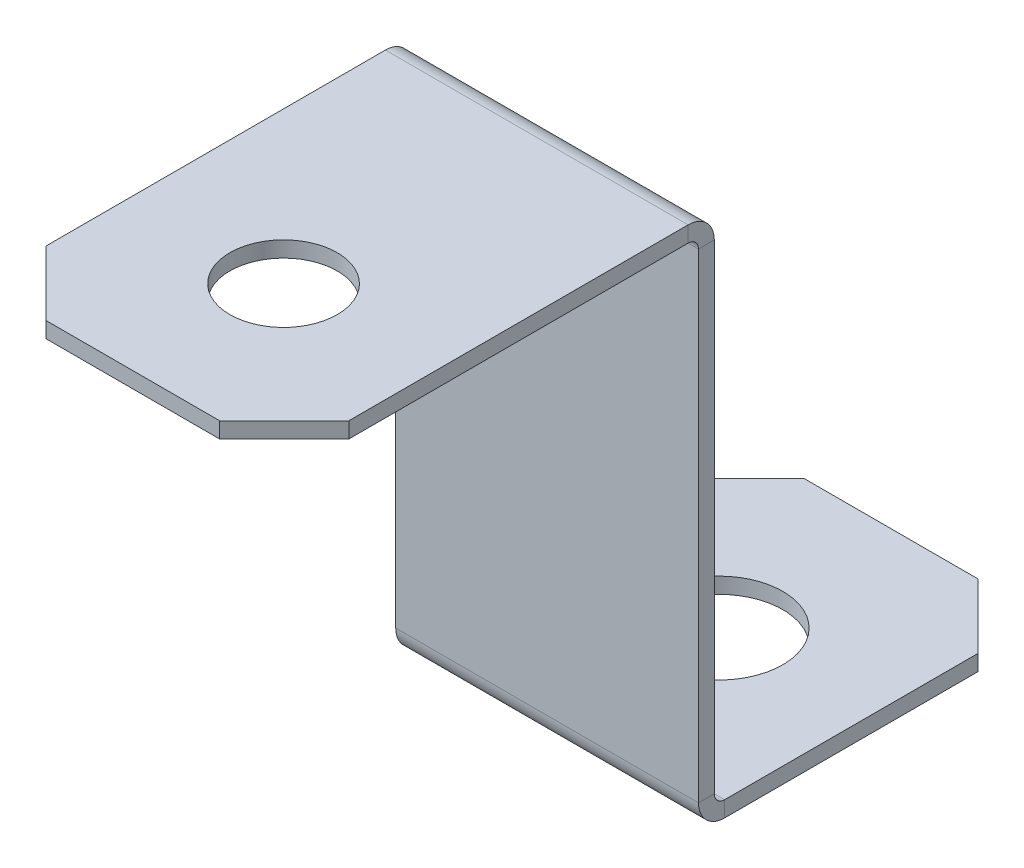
ISO-10303-21;
HEADER;
FILE_DESCRIPTION(('STEP AP214'),'2;1');
FILE_NAME('part.step','',(''),(''),'','','');
FILE_SCHEMA(('AUTOMOTIVE_DESIGN { 1 0 10303 214 1 1 1 1 }'));
ENDSEC;
DATA;
#1=APPLICATION_CONTEXT('core data for automotive mechanical design processes');
#2=APPLICATION_PROTOCOL_DEFINITION('international standard','automotive_design',2000,#1);
#3=PRODUCT_CONTEXT('',#1,'mechanical');
#4=PRODUCT('Part','Part','',(#3));
#5=PRODUCT_RELATED_PRODUCT_CATEGORY('part','',(#4));
#6=PRODUCT_DEFINITION_FORMATION('','',#4);
#7=PRODUCT_DEFINITION_CONTEXT('part definition',#1,'design');
#8=PRODUCT_DEFINITION('design','',#6,#7);
#9=PRODUCT_DEFINITION_SHAPE('','',#8);
#10=(LENGTH_UNIT() NAMED_UNIT(*) SI_UNIT(.MILLI.,.METRE.));
#11=(NAMED_UNIT(*) PLANE_ANGLE_UNIT() SI_UNIT($,.RADIAN.));
#12=(NAMED_UNIT(*) SI_UNIT($,.STERADIAN.) SOLID_ANGLE_UNIT());
#13=UNCERTAINTY_MEASURE_WITH_UNIT(LENGTH_MEASURE(1.E-05),#10,'distance_accuracy_value','');
#14=(GEOMETRIC_REPRESENTATION_CONTEXT(3) GLOBAL_UNCERTAINTY_ASSIGNED_CONTEXT((#13)) GLOBAL_UNIT_ASSIGNED_CONTEXT((#10,
#11,#12)) REPRESENTATION_CONTEXT('',''));
#15=CARTESIAN_POINT('',(0.,0.,0.));
#16=DIRECTION('',(0.,0.,1.));
#17=DIRECTION('',(1.,0.,0.));
#18=AXIS2_PLACEMENT_3D('',#15,#16,#17);
#19=CARTESIAN_POINT('',(5.588,-0.9652,-10.3124));
#20=DIRECTION('',(1.,0.,0.));
#21=DIRECTION('',(0.,0.,-1.));
#22=AXIS2_PLACEMENT_3D('',#19,#20,#21);
#23=PLANE('',#22);
#24=DIRECTION('',(0.,0.,1.));
#25=VECTOR('',#24,1.);
#26=CARTESIAN_POINT('',(5.588,-0.9652,-10.3124));
#27=LINE('',#26,#25);
#28=CARTESIAN_POINT('',(5.588,-0.9652,-10.3124));
#29=VERTEX_POINT('',#28);
#30=CARTESIAN_POINT('',(5.588,-0.9652,-9.7282));
#31=VERTEX_POINT('',#30);
#32=EDGE_CURVE('E270',#29,#31,#27,.T.);
#33=ORIENTED_EDGE('',*,*,#32,.F.);
#34=CARTESIAN_POINT('',(5.588,-0.9652,-9.3472));
#35=DIRECTION('',(1.,0.,0.));
#36=DIRECTION('',(0.,0.,-1.));
#37=AXIS2_PLACEMENT_3D('',#34,#35,#36);
#38=CIRCLE('',#37,0.9652);
#39=CARTESIAN_POINT('',(5.588,0.,-9.3472));
#40=VERTEX_POINT('',#39);
#41=EDGE_CURVE('E187',#40,#29,#38,.F.);
#42=ORIENTED_EDGE('',*,*,#41,.F.);
#43=DIRECTION('',(0.,1.,0.));
#44=VECTOR('',#43,1.);
#45=CARTESIAN_POINT('',(5.588,-0.5842,-9.3472));
#46=LINE('',#45,#44);
#47=CARTESIAN_POINT('',(5.588,-0.5842,-9.3472));
#48=VERTEX_POINT('',#47);
#49=EDGE_CURVE('E267',#48,#40,#46,.T.);
#50=ORIENTED_EDGE('',*,*,#49,.F.);
#51=CARTESIAN_POINT('',(5.588,-0.9652,-9.3472));
#52=DIRECTION('',(1.,0.,0.));
#53=DIRECTION('',(0.,0.,-1.));
#54=AXIS2_PLACEMENT_3D('',#51,#52,#53);
#55=CIRCLE('',#54,0.381);
#56=EDGE_CURVE('E197',#48,#31,#55,.F.);
#57=ORIENTED_EDGE('',*,*,#56,.T.);
#58=EDGE_LOOP('',(#33,#42,#50,#57));
#59=FACE_BOUND('',#58,.T.);
#60=ADVANCED_FACE('F37',(#59),#23,.T.);
#61=CARTESIAN_POINT('',(5.588,-0.5842,-9.3472));
#62=DIRECTION('',(1.,0.,0.));
#63=DIRECTION('',(0.,0.,-1.));
#64=AXIS2_PLACEMENT_3D('',#61,#62,#63);
#65=PLANE('',#64);
#66=DIRECTION('',(0.,-1.,0.));
#67=VECTOR('',#66,1.);
#68=CARTESIAN_POINT('',(5.588,0.,-10.3124));
#69=LINE('',#68,#67);
#70=CARTESIAN_POINT('',(5.588,-18.669,-10.3124));
#71=VERTEX_POINT('',#70);
#72=EDGE_CURVE('E185',#29,#71,#69,.T.);
#73=ORIENTED_EDGE('',*,*,#72,.F.);
#74=ORIENTED_EDGE('',*,*,#32,.T.);
#75=DIRECTION('',(0.,-1.,0.));
#76=VECTOR('',#75,1.);
#77=CARTESIAN_POINT('',(5.588,0.,-9.7282));
#78=LINE('',#77,#76);
#79=CARTESIAN_POINT('',(5.588,-18.669,-9.7282));
#80=VERTEX_POINT('',#79);
#81=EDGE_CURVE('E200',#31,#80,#78,.T.);
#82=ORIENTED_EDGE('',*,*,#81,.T.);
#83=DIRECTION('',(0.,0.,-1.));
#84=VECTOR('',#83,1.);
#85=CARTESIAN_POINT('',(5.588,-18.669,-9.7282));
#86=LINE('',#85,#84);
#87=EDGE_CURVE('E162',#80,#71,#86,.T.);
#88=ORIENTED_EDGE('',*,*,#87,.T.);
#89=EDGE_LOOP('',(#73,#74,#82,#88));
#90=FACE_BOUND('',#89,.T.);
#91=ADVANCED_FACE('F347',(#90),#65,.T.);
#92=CARTESIAN_POINT('',(-5.588,0.,-9.3472));
#93=DIRECTION('',(-1.,0.,0.));
#94=DIRECTION('',(0.,0.,1.));
#95=AXIS2_PLACEMENT_3D('',#92,#93,#94);
#96=PLANE('',#95);
#97=DIRECTION('',(0.,-1.,0.));
#98=VECTOR('',#97,1.);
#99=CARTESIAN_POINT('',(-5.588,0.,-9.3472));
#100=LINE('',#99,#98);
#101=CARTESIAN_POINT('',(-5.588,0.,-9.3472));
#102=VERTEX_POINT('',#101);
#103=CARTESIAN_POINT('',(-5.588,-0.5842,-9.3472));
#104=VERTEX_POINT('',#103);
#105=EDGE_CURVE('E264',#102,#104,#100,.T.);
#106=ORIENTED_EDGE('',*,*,#105,.F.);
#107=CARTESIAN_POINT('',(-5.588,-0.9652,-9.3472));
#108=DIRECTION('',(1.,0.,0.));
#109=DIRECTION('',(0.,0.,-1.));
#110=AXIS2_PLACEMENT_3D('',#107,#108,#109);
#111=CIRCLE('',#110,0.9652);
#112=CARTESIAN_POINT('',(-5.588,-0.9652,-10.3124));
#113=VERTEX_POINT('',#112);
#114=EDGE_CURVE('E215',#102,#113,#111,.F.);
#115=ORIENTED_EDGE('',*,*,#114,.T.);
#116=DIRECTION('',(0.,0.,-1.));
#117=VECTOR('',#116,1.);
#118=CARTESIAN_POINT('',(-5.588,-0.9652,-9.7282));
#119=LINE('',#118,#117);
#120=CARTESIAN_POINT('',(-5.588,-0.9652,-9.7282));
#121=VERTEX_POINT('',#120);
#122=EDGE_CURVE('E161',#121,#113,#119,.T.);
#123=ORIENTED_EDGE('',*,*,#122,.F.);
#124=CARTESIAN_POINT('',(-5.588,-0.9652,-9.3472));
#125=DIRECTION('',(1.,0.,0.));
#126=DIRECTION('',(0.,0.,-1.));
#127=AXIS2_PLACEMENT_3D('',#124,#125,#126);
#128=CIRCLE('',#127,0.381);
#129=EDGE_CURVE('E222',#104,#121,#128,.F.);
#130=ORIENTED_EDGE('',*,*,#129,.F.);
#131=EDGE_LOOP('',(#106,#115,#123,#130));
#132=FACE_BOUND('',#131,.T.);
#133=ADVANCED_FACE('F353',(#132),#96,.T.);
#134=CARTESIAN_POINT('',(-5.588,-0.9652,-9.7282));
#135=DIRECTION('',(-1.,0.,0.));
#136=DIRECTION('',(0.,0.,1.));
#137=AXIS2_PLACEMENT_3D('',#134,#135,#136);
#138=PLANE('',#137);
#139=DIRECTION('',(0.,0.,-1.));
#140=VECTOR('',#139,1.);
#141=CARTESIAN_POINT('',(-5.588,-0.5842,5.5626));
#142=LINE('',#141,#140);
#143=CARTESIAN_POINT('',(-5.588,-0.5842,3.18135000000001));
#144=VERTEX_POINT('',#143);
#145=EDGE_CURVE('E220',#144,#104,#142,.T.);
#146=ORIENTED_EDGE('',*,*,#145,.F.);
#147=DIRECTION('',(0.,1.,0.));
#148=VECTOR('',#147,1.);
#149=CARTESIAN_POINT('',(-5.588,-0.9652,3.18135000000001));
#150=LINE('',#149,#148);
#151=CARTESIAN_POINT('',(-5.588,0.,3.18135000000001));
#152=VERTEX_POINT('',#151);
#153=EDGE_CURVE('E272',#144,#152,#150,.T.);
#154=ORIENTED_EDGE('',*,*,#153,.T.);
#155=DIRECTION('',(0.,0.,-1.));
#156=VECTOR('',#155,1.);
#157=CARTESIAN_POINT('',(-5.588,0.,5.5626));
#158=LINE('',#157,#156);
#159=EDGE_CURVE('E218',#152,#102,#158,.T.);
#160=ORIENTED_EDGE('',*,*,#159,.T.);
#161=ORIENTED_EDGE('',*,*,#105,.T.);
#162=EDGE_LOOP('',(#146,#154,#160,#161));
#163=FACE_BOUND('',#162,.T.);
#164=ADVANCED_FACE('F451',(#163),#138,.T.);
#165=CARTESIAN_POINT('',(5.588,-19.05,-10.6934));
#166=DIRECTION('',(1.,0.,0.));
#167=DIRECTION('',(0.,0.,-1.));
#168=AXIS2_PLACEMENT_3D('',#165,#166,#167);
#169=PLANE('',#168);
#170=DIRECTION('',(0.,-1.,0.));
#171=VECTOR('',#170,1.);
#172=CARTESIAN_POINT('',(5.588,-19.05,-10.6934));
#173=LINE('',#172,#171);
#174=CARTESIAN_POINT('',(5.588,-19.05,-10.6934));
#175=VERTEX_POINT('',#174);
#176=CARTESIAN_POINT('',(5.588,-19.6342,-10.6934));
#177=VERTEX_POINT('',#176);
#178=EDGE_CURVE('E152',#175,#177,#173,.T.);
#179=ORIENTED_EDGE('',*,*,#178,.F.);
#180=CARTESIAN_POINT('',(5.588,-18.669,-10.6934));
#181=DIRECTION('',(-1.,0.,0.));
#182=DIRECTION('',(0.,0.,1.));
#183=AXIS2_PLACEMENT_3D('',#180,#181,#182);
#184=CIRCLE('',#183,0.381);
#185=EDGE_CURVE('E156',#71,#175,#184,.F.);
#186=ORIENTED_EDGE('',*,*,#185,.F.);
#187=ORIENTED_EDGE('',*,*,#87,.F.);
#188=CARTESIAN_POINT('',(5.588,-18.669,-10.6934));
#189=DIRECTION('',(1.,0.,0.));
#190=DIRECTION('',(0.,0.,-1.));
#191=AXIS2_PLACEMENT_3D('',#188,#189,#190);
#192=CIRCLE('',#191,0.9652);
#193=EDGE_CURVE('E159',#80,#177,#192,.T.);
#194=ORIENTED_EDGE('',*,*,#193,.T.);
#195=EDGE_LOOP('',(#179,#186,#187,#194));
#196=FACE_BOUND('',#195,.T.);
#197=ADVANCED_FACE('F154',(#196),#169,.T.);
#198=CARTESIAN_POINT('',(5.588,-18.669,-9.7282));
#199=DIRECTION('',(1.,0.,0.));
#200=DIRECTION('',(0.,0.,-1.));
#201=AXIS2_PLACEMENT_3D('',#198,#199,#200);
#202=PLANE('',#201);
#203=DIRECTION('',(0.,0.,-1.));
#204=VECTOR('',#203,1.);
#205=CARTESIAN_POINT('',(5.588,-19.6342,-10.3124));
#206=LINE('',#205,#204);
#207=CARTESIAN_POINT('',(5.588,-19.6342,-20.04695));
#208=VERTEX_POINT('',#207);
#209=EDGE_CURVE('E180',#177,#208,#206,.T.);
#210=ORIENTED_EDGE('',*,*,#209,.T.);
#211=DIRECTION('',(0.,1.,0.));
#212=VECTOR('',#211,1.);
#213=CARTESIAN_POINT('',(5.588,-18.669,-20.04695));
#214=LINE('',#213,#212);
#215=CARTESIAN_POINT('',(5.588,-19.05,-20.04695));
#216=VERTEX_POINT('',#215);
#217=EDGE_CURVE('E11',#208,#216,#214,.T.);
#218=ORIENTED_EDGE('',*,*,#217,.T.);
#219=DIRECTION('',(0.,0.,-1.));
#220=VECTOR('',#219,1.);
#221=CARTESIAN_POINT('',(5.588,-19.05,-10.3124));
#222=LINE('',#221,#220);
#223=EDGE_CURVE('E169',#175,#216,#222,.T.);
#224=ORIENTED_EDGE('',*,*,#223,.F.);
#225=ORIENTED_EDGE('',*,*,#178,.T.);
#226=EDGE_LOOP('',(#210,#218,#224,#225));
#227=FACE_BOUND('',#226,.T.);
#228=ADVANCED_FACE('F179',(#227),#202,.T.);
#229=CARTESIAN_POINT('',(-5.588,-18.669,-10.3124));
#230=DIRECTION('',(-1.,0.,0.));
#231=DIRECTION('',(0.,0.,1.));
#232=AXIS2_PLACEMENT_3D('',#229,#230,#231);
#233=PLANE('',#232);
#234=DIRECTION('',(0.,0.,1.));
#235=VECTOR('',#234,1.);
#236=CARTESIAN_POINT('',(-5.588,-18.669,-10.3124));
#237=LINE('',#236,#235);
#238=CARTESIAN_POINT('',(-5.588,-18.669,-10.3124));
#239=VERTEX_POINT('',#238);
#240=CARTESIAN_POINT('',(-5.588,-18.669,-9.7282));
#241=VERTEX_POINT('',#240);
#242=EDGE_CURVE('E260',#239,#241,#237,.T.);
#243=ORIENTED_EDGE('',*,*,#242,.F.);
#244=CARTESIAN_POINT('',(-5.588,-18.669,-10.6934));
#245=DIRECTION('',(-1.,0.,0.));
#246=DIRECTION('',(0.,0.,1.));
#247=AXIS2_PLACEMENT_3D('',#244,#245,#246);
#248=CIRCLE('',#247,0.381);
#249=CARTESIAN_POINT('',(-5.588,-19.05,-10.6934));
#250=VERTEX_POINT('',#249);
#251=EDGE_CURVE('E210',#239,#250,#248,.F.);
#252=ORIENTED_EDGE('',*,*,#251,.T.);
#253=DIRECTION('',(0.,1.,0.));
#254=VECTOR('',#253,1.);
#255=CARTESIAN_POINT('',(-5.588,-19.6342,-10.6934));
#256=LINE('',#255,#254);
#257=CARTESIAN_POINT('',(-5.588,-19.6342,-10.6934));
#258=VERTEX_POINT('',#257);
#259=EDGE_CURVE('E258',#258,#250,#256,.T.);
#260=ORIENTED_EDGE('',*,*,#259,.F.);
#261=CARTESIAN_POINT('',(-5.588,-18.669,-10.6934));
#262=DIRECTION('',(1.,0.,0.));
#263=DIRECTION('',(0.,0.,-1.));
#264=AXIS2_PLACEMENT_3D('',#261,#262,#263);
#265=CIRCLE('',#264,0.9652);
#266=EDGE_CURVE('E228',#241,#258,#265,.T.);
#267=ORIENTED_EDGE('',*,*,#266,.F.);
#268=EDGE_LOOP('',(#243,#252,#260,#267));
#269=FACE_BOUND('',#268,.T.);
#270=ADVANCED_FACE('F436',(#269),#233,.T.);
#271=CARTESIAN_POINT('',(-5.588,-19.6342,-10.6934));
#272=DIRECTION('',(-1.,0.,0.));
#273=DIRECTION('',(0.,0.,1.));
#274=AXIS2_PLACEMENT_3D('',#271,#272,#273);
#275=PLANE('',#274);
#276=DIRECTION('',(0.,-1.,0.));
#277=VECTOR('',#276,1.);
#278=CARTESIAN_POINT('',(-5.588,0.,-10.3124));
#279=LINE('',#278,#277);
#280=EDGE_CURVE('E212',#113,#239,#279,.T.);
#281=ORIENTED_EDGE('',*,*,#280,.T.);
#282=ORIENTED_EDGE('',*,*,#242,.T.);
#283=DIRECTION('',(0.,-1.,0.));
#284=VECTOR('',#283,1.);
#285=CARTESIAN_POINT('',(-5.588,0.,-9.7282));
#286=LINE('',#285,#284);
#287=EDGE_CURVE('E225',#121,#241,#286,.T.);
#288=ORIENTED_EDGE('',*,*,#287,.F.);
#289=ORIENTED_EDGE('',*,*,#122,.T.);
#290=EDGE_LOOP('',(#281,#282,#288,#289));
#291=FACE_BOUND('',#290,.T.);
#292=ADVANCED_FACE('F437',(#291),#275,.T.);
#293=CARTESIAN_POINT('',(5.588,-19.6342,-10.3124));
#294=DIRECTION('',(0.,1.,0.));
#295=DIRECTION('',(0.,0.,1.));
#296=AXIS2_PLACEMENT_3D('',#293,#294,#295);
#297=PLANE('',#296);
#298=CARTESIAN_POINT('',(0.,-19.6342,-16.0782));
#299=DIRECTION('',(0.,1.,0.));
#300=DIRECTION('',(0.,0.,1.));
#301=AXIS2_PLACEMENT_3D('',#298,#299,#300);
#302=CIRCLE('',#301,2.3495);
#303=CARTESIAN_POINT('',(0.,-19.6342,-13.7287));
#304=VERTEX_POINT('',#303);
#305=EDGE_CURVE('E320',#304,#304,#302,.T.);
#306=ORIENTED_EDGE('',*,*,#305,.T.);
#307=EDGE_LOOP('',(#306));
#308=FACE_BOUND('',#307,.T.);
#309=DIRECTION('',(0.,0.,-1.));
#310=VECTOR('',#309,1.);
#311=CARTESIAN_POINT('',(-5.588,-19.6342,-10.3124));
#312=LINE('',#311,#310);
#313=CARTESIAN_POINT('',(-5.588,-19.6342,-20.04695));
#314=VERTEX_POINT('',#313);
#315=EDGE_CURVE('E205',#258,#314,#312,.T.);
#316=ORIENTED_EDGE('',*,*,#315,.T.);
#317=DIRECTION('',(-0.707106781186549,0.,0.707106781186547));
#318=VECTOR('',#317,1.);
#319=CARTESIAN_POINT('',(-5.588,-19.6342,-20.04695));
#320=LINE('',#319,#318);
#321=CARTESIAN_POINT('',(-3.20675,-19.6342,-22.4282));
#322=VERTEX_POINT('',#321);
#323=EDGE_CURVE('E295',#314,#322,#320,.F.);
#324=ORIENTED_EDGE('',*,*,#323,.T.);
#325=DIRECTION('',(-1.,0.,0.));
#326=VECTOR('',#325,1.);
#327=CARTESIAN_POINT('',(5.588,-19.6342,-22.4282));
#328=LINE('',#327,#326);
#329=CARTESIAN_POINT('',(3.20675,-19.6342,-22.4282));
#330=VERTEX_POINT('',#329);
#331=EDGE_CURVE('E256',#330,#322,#328,.T.);
#332=ORIENTED_EDGE('',*,*,#331,.F.);
#333=DIRECTION('',(-0.707106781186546,0.,-0.707106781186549));
#334=VECTOR('',#333,1.);
#335=CARTESIAN_POINT('',(3.20675,-19.6342,-22.4282));
#336=LINE('',#335,#334);
#337=EDGE_CURVE('E293',#330,#208,#336,.F.);
#338=ORIENTED_EDGE('',*,*,#337,.T.);
#339=ORIENTED_EDGE('',*,*,#209,.F.);
#340=DIRECTION('',(-1.,0.,0.));
#341=VECTOR('',#340,1.);
#342=CARTESIAN_POINT('',(5.588,-19.6342,-10.6934));
#343=LINE('',#342,#341);
#344=EDGE_CURVE('E204',#177,#258,#343,.T.);
#345=ORIENTED_EDGE('',*,*,#344,.T.);
#346=EDGE_LOOP('',(#316,#324,#332,#338,#339,#345));
#347=FACE_BOUND('',#346,.T.);
#348=ADVANCED_FACE('F311',(#308,#347),#297,.F.);
#349=CARTESIAN_POINT('',(5.588,-19.05,-22.4282));
#350=DIRECTION('',(0.,0.,-1.));
#351=DIRECTION('',(-1.,0.,0.));
#352=AXIS2_PLACEMENT_3D('',#349,#350,#351);
#353=PLANE('',#352);
#354=ORIENTED_EDGE('',*,*,#331,.T.);
#355=DIRECTION('',(0.,1.,0.));
#356=VECTOR('',#355,1.);
#357=CARTESIAN_POINT('',(-3.20675,-19.05,-22.4282));
#358=LINE('',#357,#356);
#359=CARTESIAN_POINT('',(-3.20675,-19.05,-22.4282));
#360=VERTEX_POINT('',#359);
#361=EDGE_CURVE('E58',#322,#360,#358,.T.);
#362=ORIENTED_EDGE('',*,*,#361,.T.);
#363=DIRECTION('',(-1.,0.,0.));
#364=VECTOR('',#363,1.);
#365=CARTESIAN_POINT('',(5.588,-19.05,-22.4282));
#366=LINE('',#365,#364);
#367=CARTESIAN_POINT('',(3.20675,-19.05,-22.4282));
#368=VERTEX_POINT('',#367);
#369=EDGE_CURVE('E176',#368,#360,#366,.T.);
#370=ORIENTED_EDGE('',*,*,#369,.F.);
#371=DIRECTION('',(0.,-1.,0.));
#372=VECTOR('',#371,1.);
#373=CARTESIAN_POINT('',(3.20675,-19.05,-22.4282));
#374=LINE('',#373,#372);
#375=EDGE_CURVE('E297',#368,#330,#374,.T.);
#376=ORIENTED_EDGE('',*,*,#375,.T.);
#377=EDGE_LOOP('',(#354,#362,#370,#376));
#378=FACE_BOUND('',#377,.T.);
#379=ADVANCED_FACE('F312',(#378),#353,.T.);
#380=CARTESIAN_POINT('',(5.588,-19.05,-10.3124));
#381=DIRECTION('',(0.,1.,0.));
#382=DIRECTION('',(0.,0.,1.));
#383=AXIS2_PLACEMENT_3D('',#380,#381,#382);
#384=PLANE('',#383);
#385=CARTESIAN_POINT('',(0.,-19.05,-16.0782));
#386=DIRECTION('',(0.,1.,0.));
#387=DIRECTION('',(0.,0.,1.));
#388=AXIS2_PLACEMENT_3D('',#385,#386,#387);
#389=CIRCLE('',#388,2.3495);
#390=CARTESIAN_POINT('',(0.,-19.05,-13.7287));
#391=VERTEX_POINT('',#390);
#392=EDGE_CURVE('E323',#391,#391,#389,.T.);
#393=ORIENTED_EDGE('',*,*,#392,.F.);
#394=EDGE_LOOP('',(#393));
#395=FACE_BOUND('',#394,.T.);
#396=ORIENTED_EDGE('',*,*,#369,.T.);
#397=DIRECTION('',(0.707106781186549,0.,-0.707106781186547));
#398=VECTOR('',#397,1.);
#399=CARTESIAN_POINT('',(-4.86727499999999,-19.05,-20.767675));
#400=LINE('',#399,#398);
#401=CARTESIAN_POINT('',(-5.588,-19.05,-20.04695));
#402=VERTEX_POINT('',#401);
#403=EDGE_CURVE('E45',#360,#402,#400,.F.);
#404=ORIENTED_EDGE('',*,*,#403,.T.);
#405=DIRECTION('',(0.,0.,-1.));
#406=VECTOR('',#405,1.);
#407=CARTESIAN_POINT('',(-5.588,-19.05,-10.3124));
#408=LINE('',#407,#406);
#409=EDGE_CURVE('E172',#250,#402,#408,.T.);
#410=ORIENTED_EDGE('',*,*,#409,.F.);
#411=DIRECTION('',(-1.,0.,0.));
#412=VECTOR('',#411,1.);
#413=CARTESIAN_POINT('',(5.588,-19.05,-10.6934));
#414=LINE('',#413,#412);
#415=EDGE_CURVE('E167',#175,#250,#414,.T.);
#416=ORIENTED_EDGE('',*,*,#415,.F.);
#417=ORIENTED_EDGE('',*,*,#223,.T.);
#418=DIRECTION('',(0.707106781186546,0.,0.707106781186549));
#419=VECTOR('',#418,1.);
#420=CARTESIAN_POINT('',(10.455275,-19.05,-15.179675));
#421=LINE('',#420,#419);
#422=EDGE_CURVE('E301',#216,#368,#421,.F.);
#423=ORIENTED_EDGE('',*,*,#422,.T.);
#424=EDGE_LOOP('',(#396,#404,#410,#416,#417,#423));
#425=FACE_BOUND('',#424,.T.);
#426=ADVANCED_FACE('F168',(#395,#425),#384,.T.);
#427=CARTESIAN_POINT('',(5.588,-18.669,-10.6934));
#428=DIRECTION('',(-1.,0.,0.));
#429=DIRECTION('',(0.,0.,1.));
#430=AXIS2_PLACEMENT_3D('',#427,#428,#429);
#431=CYLINDRICAL_SURFACE('',#430,0.381);
#432=ORIENTED_EDGE('',*,*,#251,.F.);
#433=DIRECTION('',(-1.,0.,0.));
#434=VECTOR('',#433,1.);
#435=CARTESIAN_POINT('',(5.588,-18.669,-10.3124));
#436=LINE('',#435,#434);
#437=EDGE_CURVE('E177',#71,#239,#436,.T.);
#438=ORIENTED_EDGE('',*,*,#437,.F.);
#439=ORIENTED_EDGE('',*,*,#185,.T.);
#440=ORIENTED_EDGE('',*,*,#415,.T.);
#441=EDGE_LOOP('',(#432,#438,#439,#440));
#442=FACE_BOUND('',#441,.T.);
#443=ADVANCED_FACE('F183',(#442),#431,.F.);
#444=CARTESIAN_POINT('',(5.588,0.,-10.3124));
#445=DIRECTION('',(0.,0.,-1.));
#446=DIRECTION('',(0.,1.,0.));
#447=AXIS2_PLACEMENT_3D('',#444,#445,#446);
#448=PLANE('',#447);
#449=ORIENTED_EDGE('',*,*,#280,.F.);
#450=DIRECTION('',(-1.,0.,0.));
#451=VECTOR('',#450,1.);
#452=CARTESIAN_POINT('',(5.588,-0.9652,-10.3124));
#453=LINE('',#452,#451);
#454=EDGE_CURVE('E251',#29,#113,#453,.T.);
#455=ORIENTED_EDGE('',*,*,#454,.F.);
#456=ORIENTED_EDGE('',*,*,#72,.T.);
#457=ORIENTED_EDGE('',*,*,#437,.T.);
#458=EDGE_LOOP('',(#449,#455,#456,#457));
#459=FACE_BOUND('',#458,.T.);
#460=ADVANCED_FACE('F343',(#459),#448,.T.);
#461=CARTESIAN_POINT('',(5.588,-0.9652,-9.3472));
#462=DIRECTION('',(-1.,0.,0.));
#463=DIRECTION('',(0.,0.,1.));
#464=AXIS2_PLACEMENT_3D('',#461,#462,#463);
#465=CYLINDRICAL_SURFACE('',#464,0.9652);
#466=ORIENTED_EDGE('',*,*,#114,.F.);
#467=DIRECTION('',(-1.,0.,0.));
#468=VECTOR('',#467,1.);
#469=CARTESIAN_POINT('',(5.588,0.,-9.3472));
#470=LINE('',#469,#468);
#471=EDGE_CURVE('E248',#40,#102,#470,.T.);
#472=ORIENTED_EDGE('',*,*,#471,.F.);
#473=ORIENTED_EDGE('',*,*,#41,.T.);
#474=ORIENTED_EDGE('',*,*,#454,.T.);
#475=EDGE_LOOP('',(#466,#472,#473,#474));
#476=FACE_BOUND('',#475,.T.);
#477=ADVANCED_FACE('F408',(#476),#465,.T.);
#478=CARTESIAN_POINT('',(5.588,0.,5.5626));
#479=DIRECTION('',(0.,1.,0.));
#480=DIRECTION('',(0.,0.,1.));
#481=AXIS2_PLACEMENT_3D('',#478,#479,#480);
#482=PLANE('',#481);
#483=CARTESIAN_POINT('',(0.,0.,0.));
#484=DIRECTION('',(0.,1.,0.));
#485=DIRECTION('',(0.,0.,1.));
#486=AXIS2_PLACEMENT_3D('',#483,#484,#485);
#487=CIRCLE('',#486,1.9812);
#488=CARTESIAN_POINT('',(0.,0.,1.9812));
#489=VERTEX_POINT('',#488);
#490=EDGE_CURVE('E317',#489,#489,#487,.T.);
#491=ORIENTED_EDGE('',*,*,#490,.F.);
#492=EDGE_LOOP('',(#491));
#493=FACE_BOUND('',#492,.T.);
#494=ORIENTED_EDGE('',*,*,#159,.F.);
#495=DIRECTION('',(-0.707106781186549,0.,-0.707106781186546));
#496=VECTOR('',#495,1.);
#497=CARTESIAN_POINT('',(1.19062500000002,0.,9.959975));
#498=LINE('',#497,#496);
#499=CARTESIAN_POINT('',(-3.20675,0.,5.5626));
#500=VERTEX_POINT('',#499);
#501=EDGE_CURVE('E277',#152,#500,#498,.F.);
#502=ORIENTED_EDGE('',*,*,#501,.T.);
#503=DIRECTION('',(-1.,0.,0.));
#504=VECTOR('',#503,1.);
#505=CARTESIAN_POINT('',(5.588,0.,5.5626));
#506=LINE('',#505,#504);
#507=CARTESIAN_POINT('',(3.20675,0.,5.5626));
#508=VERTEX_POINT('',#507);
#509=EDGE_CURVE('E245',#508,#500,#506,.T.);
#510=ORIENTED_EDGE('',*,*,#509,.F.);
#511=DIRECTION('',(0.707106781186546,0.,-0.707106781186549));
#512=VECTOR('',#511,1.);
#513=CARTESIAN_POINT('',(4.39737499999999,0.,4.371975));
#514=LINE('',#513,#512);
#515=CARTESIAN_POINT('',(5.588,0.,3.18134999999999));
#516=VERTEX_POINT('',#515);
#517=EDGE_CURVE('E275',#508,#516,#514,.T.);
#518=ORIENTED_EDGE('',*,*,#517,.T.);
#519=DIRECTION('',(0.,0.,-1.));
#520=VECTOR('',#519,1.);
#521=CARTESIAN_POINT('',(5.588,0.,5.5626));
#522=LINE('',#521,#520);
#523=EDGE_CURVE('E193',#516,#40,#522,.T.);
#524=ORIENTED_EDGE('',*,*,#523,.T.);
#525=ORIENTED_EDGE('',*,*,#471,.T.);
#526=EDGE_LOOP('',(#494,#502,#510,#518,#524,#525));
#527=FACE_BOUND('',#526,.T.);
#528=ADVANCED_FACE('F404',(#493,#527),#482,.T.);
#529=CARTESIAN_POINT('',(5.588,-0.5842,5.5626));
#530=DIRECTION('',(0.,0.,1.));
#531=DIRECTION('',(1.,0.,0.));
#532=AXIS2_PLACEMENT_3D('',#529,#530,#531);
#533=PLANE('',#532);
#534=ORIENTED_EDGE('',*,*,#509,.T.);
#535=DIRECTION('',(0.,-1.,0.));
#536=VECTOR('',#535,1.);
#537=CARTESIAN_POINT('',(-3.20675,-0.5842,5.5626));
#538=LINE('',#537,#536);
#539=CARTESIAN_POINT('',(-3.20675,-0.5842,5.5626));
#540=VERTEX_POINT('',#539);
#541=EDGE_CURVE('E282',#500,#540,#538,.T.);
#542=ORIENTED_EDGE('',*,*,#541,.T.);
#543=DIRECTION('',(-1.,0.,0.));
#544=VECTOR('',#543,1.);
#545=CARTESIAN_POINT('',(5.588,-0.5842,5.5626));
#546=LINE('',#545,#544);
#547=CARTESIAN_POINT('',(3.20675,-0.5842,5.5626));
#548=VERTEX_POINT('',#547);
#549=EDGE_CURVE('E242',#548,#540,#546,.T.);
#550=ORIENTED_EDGE('',*,*,#549,.F.);
#551=DIRECTION('',(0.,1.,0.));
#552=VECTOR('',#551,1.);
#553=CARTESIAN_POINT('',(3.20675,0.,5.5626));
#554=LINE('',#553,#552);
#555=EDGE_CURVE('E279',#548,#508,#554,.T.);
#556=ORIENTED_EDGE('',*,*,#555,.T.);
#557=EDGE_LOOP('',(#534,#542,#550,#556));
#558=FACE_BOUND('',#557,.T.);
#559=ADVANCED_FACE('F400',(#558),#533,.T.);
#560=CARTESIAN_POINT('',(5.588,-0.5842,5.5626));
#561=DIRECTION('',(0.,1.,0.));
#562=DIRECTION('',(0.,0.,1.));
#563=AXIS2_PLACEMENT_3D('',#560,#561,#562);
#564=PLANE('',#563);
#565=CARTESIAN_POINT('',(0.,-0.5842,0.));
#566=DIRECTION('',(0.,1.,0.));
#567=DIRECTION('',(0.,0.,1.));
#568=AXIS2_PLACEMENT_3D('',#565,#566,#567);
#569=CIRCLE('',#568,1.9812);
#570=CARTESIAN_POINT('',(0.,-0.5842,1.9812));
#571=VERTEX_POINT('',#570);
#572=EDGE_CURVE('E208',#571,#571,#569,.T.);
#573=ORIENTED_EDGE('',*,*,#572,.T.);
#574=EDGE_LOOP('',(#573));
#575=FACE_BOUND('',#574,.T.);
#576=ORIENTED_EDGE('',*,*,#549,.T.);
#577=DIRECTION('',(0.707106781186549,0.,0.707106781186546));
#578=VECTOR('',#577,1.);
#579=CARTESIAN_POINT('',(-5.588,-0.5842,3.18135000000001));
#580=LINE('',#579,#578);
#581=EDGE_CURVE('E286',#540,#144,#580,.F.);
#582=ORIENTED_EDGE('',*,*,#581,.T.);
#583=ORIENTED_EDGE('',*,*,#145,.T.);
#584=DIRECTION('',(-1.,0.,0.));
#585=VECTOR('',#584,1.);
#586=CARTESIAN_POINT('',(5.588,-0.5842,-9.3472));
#587=LINE('',#586,#585);
#588=EDGE_CURVE('E239',#48,#104,#587,.T.);
#589=ORIENTED_EDGE('',*,*,#588,.F.);
#590=DIRECTION('',(0.,0.,-1.));
#591=VECTOR('',#590,1.);
#592=CARTESIAN_POINT('',(5.588,-0.5842,5.5626));
#593=LINE('',#592,#591);
#594=CARTESIAN_POINT('',(5.588,-0.5842,3.18134999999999));
#595=VERTEX_POINT('',#594);
#596=EDGE_CURVE('E195',#595,#48,#593,.T.);
#597=ORIENTED_EDGE('',*,*,#596,.F.);
#598=DIRECTION('',(-0.707106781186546,0.,0.707106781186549));
#599=VECTOR('',#598,1.);
#600=CARTESIAN_POINT('',(3.20675,-0.5842,5.5626));
#601=LINE('',#600,#599);
#602=EDGE_CURVE('E284',#595,#548,#601,.T.);
#603=ORIENTED_EDGE('',*,*,#602,.T.);
#604=EDGE_LOOP('',(#576,#582,#583,#589,#597,#603));
#605=FACE_BOUND('',#604,.T.);
#606=ADVANCED_FACE('F396',(#575,#605),#564,.F.);
#607=CARTESIAN_POINT('',(5.588,-0.9652,-9.3472));
#608=DIRECTION('',(-1.,0.,0.));
#609=DIRECTION('',(0.,0.,1.));
#610=AXIS2_PLACEMENT_3D('',#607,#608,#609);
#611=CYLINDRICAL_SURFACE('',#610,0.381);
#612=ORIENTED_EDGE('',*,*,#129,.T.);
#613=DIRECTION('',(-1.,0.,0.));
#614=VECTOR('',#613,1.);
#615=CARTESIAN_POINT('',(5.588,-0.9652,-9.7282));
#616=LINE('',#615,#614);
#617=EDGE_CURVE('E236',#31,#121,#616,.T.);
#618=ORIENTED_EDGE('',*,*,#617,.F.);
#619=ORIENTED_EDGE('',*,*,#56,.F.);
#620=ORIENTED_EDGE('',*,*,#588,.T.);
#621=EDGE_LOOP('',(#612,#618,#619,#620));
#622=FACE_BOUND('',#621,.T.);
#623=ADVANCED_FACE('F392',(#622),#611,.F.);
#624=CARTESIAN_POINT('',(5.588,0.,-9.7282));
#625=DIRECTION('',(0.,0.,-1.));
#626=DIRECTION('',(0.,1.,0.));
#627=AXIS2_PLACEMENT_3D('',#624,#625,#626);
#628=PLANE('',#627);
#629=ORIENTED_EDGE('',*,*,#287,.T.);
#630=DIRECTION('',(-1.,0.,0.));
#631=VECTOR('',#630,1.);
#632=CARTESIAN_POINT('',(5.588,-18.669,-9.7282));
#633=LINE('',#632,#631);
#634=EDGE_CURVE('E233',#80,#241,#633,.T.);
#635=ORIENTED_EDGE('',*,*,#634,.F.);
#636=ORIENTED_EDGE('',*,*,#81,.F.);
#637=ORIENTED_EDGE('',*,*,#617,.T.);
#638=EDGE_LOOP('',(#629,#635,#636,#637));
#639=FACE_BOUND('',#638,.T.);
#640=ADVANCED_FACE('F388',(#639),#628,.F.);
#641=CARTESIAN_POINT('',(5.588,-18.669,-10.6934));
#642=DIRECTION('',(-1.,0.,0.));
#643=DIRECTION('',(0.,0.,1.));
#644=AXIS2_PLACEMENT_3D('',#641,#642,#643);
#645=CYLINDRICAL_SURFACE('',#644,0.9652);
#646=ORIENTED_EDGE('',*,*,#266,.T.);
#647=ORIENTED_EDGE('',*,*,#344,.F.);
#648=ORIENTED_EDGE('',*,*,#193,.F.);
#649=ORIENTED_EDGE('',*,*,#634,.T.);
#650=EDGE_LOOP('',(#646,#647,#648,#649));
#651=FACE_BOUND('',#650,.T.);
#652=ADVANCED_FACE('F382',(#651),#645,.T.);
#653=CARTESIAN_POINT('',(5.588,-18.669,-10.6934));
#654=DIRECTION('',(-1.,0.,0.));
#655=DIRECTION('',(0.,0.,1.));
#656=AXIS2_PLACEMENT_3D('',#653,#654,#655);
#657=PLANE('',#656);
#658=ORIENTED_EDGE('',*,*,#523,.F.);
#659=DIRECTION('',(0.,-1.,0.));
#660=VECTOR('',#659,1.);
#661=CARTESIAN_POINT('',(5.588,-0.5842,3.18134999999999));
#662=LINE('',#661,#660);
#663=EDGE_CURVE('E288',#516,#595,#662,.T.);
#664=ORIENTED_EDGE('',*,*,#663,.T.);
#665=ORIENTED_EDGE('',*,*,#596,.T.);
#666=ORIENTED_EDGE('',*,*,#49,.T.);
#667=EDGE_LOOP('',(#658,#664,#665,#666));
#668=FACE_BOUND('',#667,.T.);
#669=ADVANCED_FACE('F379',(#668),#657,.F.);
#670=CARTESIAN_POINT('',(-5.588,-18.669,-10.6934));
#671=DIRECTION('',(-1.,0.,0.));
#672=DIRECTION('',(0.,0.,1.));
#673=AXIS2_PLACEMENT_3D('',#670,#671,#672);
#674=PLANE('',#673);
#675=ORIENTED_EDGE('',*,*,#409,.T.);
#676=DIRECTION('',(0.,-1.,0.));
#677=VECTOR('',#676,1.);
#678=CARTESIAN_POINT('',(-5.588,-18.669,-20.04695));
#679=LINE('',#678,#677);
#680=EDGE_CURVE('E290',#402,#314,#679,.T.);
#681=ORIENTED_EDGE('',*,*,#680,.T.);
#682=ORIENTED_EDGE('',*,*,#315,.F.);
#683=ORIENTED_EDGE('',*,*,#259,.T.);
#684=EDGE_LOOP('',(#675,#681,#682,#683));
#685=FACE_BOUND('',#684,.T.);
#686=ADVANCED_FACE('F306',(#685),#674,.T.);
#687=CARTESIAN_POINT('',(-5.588,-0.9652,3.18135000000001));
#688=DIRECTION('',(0.707106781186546,0.,-0.707106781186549));
#689=DIRECTION('',(0.,1.,0.));
#690=AXIS2_PLACEMENT_3D('',#687,#688,#689);
#691=PLANE('',#690);
#692=ORIENTED_EDGE('',*,*,#581,.F.);
#693=ORIENTED_EDGE('',*,*,#541,.F.);
#694=ORIENTED_EDGE('',*,*,#501,.F.);
#695=ORIENTED_EDGE('',*,*,#153,.F.);
#696=EDGE_LOOP('',(#692,#693,#694,#695));
#697=FACE_BOUND('',#696,.T.);
#698=ADVANCED_FACE('F358',(#697),#691,.F.);
#699=CARTESIAN_POINT('',(3.20675,-0.5842,5.5626));
#700=DIRECTION('',(0.707106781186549,0.,0.707106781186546));
#701=DIRECTION('',(0.,-1.,0.));
#702=AXIS2_PLACEMENT_3D('',#699,#700,#701);
#703=PLANE('',#702);
#704=ORIENTED_EDGE('',*,*,#602,.F.);
#705=ORIENTED_EDGE('',*,*,#663,.F.);
#706=ORIENTED_EDGE('',*,*,#517,.F.);
#707=ORIENTED_EDGE('',*,*,#555,.F.);
#708=EDGE_LOOP('',(#704,#705,#706,#707));
#709=FACE_BOUND('',#708,.T.);
#710=ADVANCED_FACE('F361',(#709),#703,.T.);
#711=CARTESIAN_POINT('',(-5.588,-18.669,-20.04695));
#712=DIRECTION('',(0.707106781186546,0.,0.707106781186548));
#713=DIRECTION('',(0.,-1.,0.));
#714=AXIS2_PLACEMENT_3D('',#711,#712,#713);
#715=PLANE('',#714);
#716=ORIENTED_EDGE('',*,*,#403,.F.);
#717=ORIENTED_EDGE('',*,*,#361,.F.);
#718=ORIENTED_EDGE('',*,*,#323,.F.);
#719=ORIENTED_EDGE('',*,*,#680,.F.);
#720=EDGE_LOOP('',(#716,#717,#718,#719));
#721=FACE_BOUND('',#720,.T.);
#722=ADVANCED_FACE('F308',(#721),#715,.F.);
#723=CARTESIAN_POINT('',(3.20675,-19.05,-22.4282));
#724=DIRECTION('',(-0.707106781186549,0.,0.707106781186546));
#725=DIRECTION('',(0.,-1.,0.));
#726=AXIS2_PLACEMENT_3D('',#723,#724,#725);
#727=PLANE('',#726);
#728=ORIENTED_EDGE('',*,*,#422,.F.);
#729=ORIENTED_EDGE('',*,*,#217,.F.);
#730=ORIENTED_EDGE('',*,*,#337,.F.);
#731=ORIENTED_EDGE('',*,*,#375,.F.);
#732=EDGE_LOOP('',(#728,#729,#730,#731));
#733=FACE_BOUND('',#732,.T.);
#734=ADVANCED_FACE('F39',(#733),#727,.F.);
#735=CARTESIAN_POINT('',(0.,-0.5842,0.));
#736=DIRECTION('',(0.,1.,0.));
#737=DIRECTION('',(0.,0.,1.));
#738=AXIS2_PLACEMENT_3D('',#735,#736,#737);
#739=CYLINDRICAL_SURFACE('',#738,1.9812);
#740=ORIENTED_EDGE('',*,*,#572,.F.);
#741=EDGE_LOOP('',(#740));
#742=FACE_BOUND('',#741,.T.);
#743=ORIENTED_EDGE('',*,*,#490,.T.);
#744=EDGE_LOOP('',(#743));
#745=FACE_BOUND('',#744,.T.);
#746=ADVANCED_FACE('F333',(#742,#745),#739,.F.);
#747=CARTESIAN_POINT('',(0.,-19.6342,-16.0782));
#748=DIRECTION('',(0.,1.,0.));
#749=DIRECTION('',(0.,0.,1.));
#750=AXIS2_PLACEMENT_3D('',#747,#748,#749);
#751=CYLINDRICAL_SURFACE('',#750,2.3495);
#752=ORIENTED_EDGE('',*,*,#305,.F.);
#753=EDGE_LOOP('',(#752));
#754=FACE_BOUND('',#753,.T.);
#755=ORIENTED_EDGE('',*,*,#392,.T.);
#756=EDGE_LOOP('',(#755));
#757=FACE_BOUND('',#756,.T.);
#758=ADVANCED_FACE('F330',(#754,#757),#751,.F.);
#759=CLOSED_SHELL('',(#60,#91,#133,#164,#197,#228,#270,#292,#348,#379,#426,#443,#460,#477,#528,
#559,#606,#623,#640,#652,#669,#686,#698,#710,#722,#734,#746,#758));
#760=MANIFOLD_SOLID_BREP('B2',#759);
#761=ADVANCED_BREP_SHAPE_REPRESENTATION('',(#18,#760),#14);
#762=SHAPE_DEFINITION_REPRESENTATION(#9,#761);
ENDSEC;
END-ISO-10303-21;
